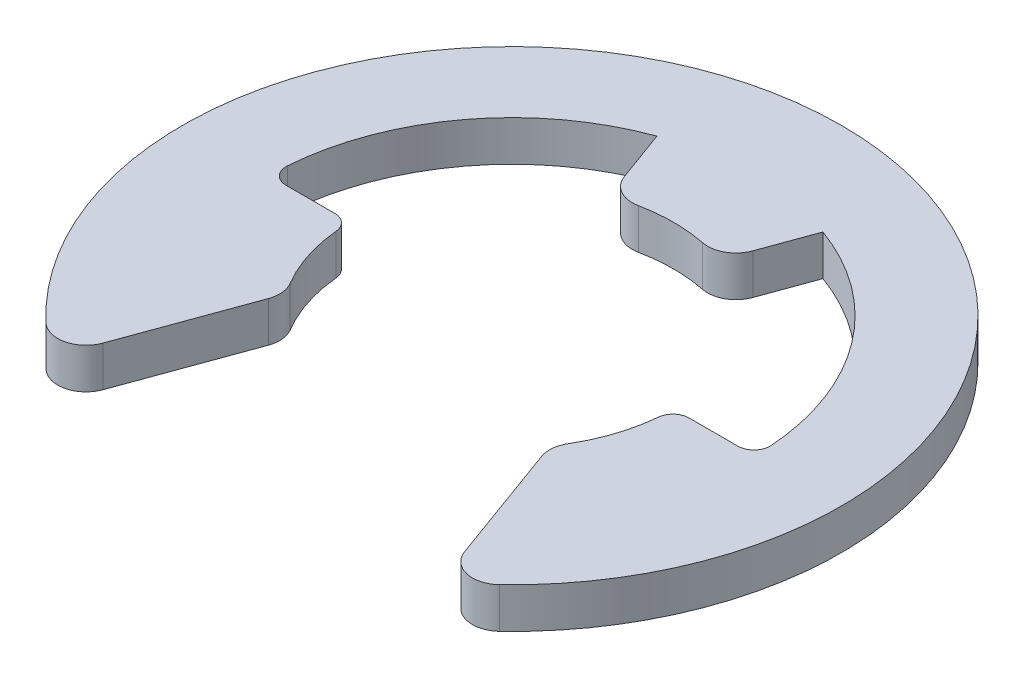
ISO-10303-21;
HEADER;
FILE_DESCRIPTION(('STEP AP214'),'2;1');
FILE_NAME('part.step','',(''),(''),'','','');
FILE_SCHEMA(('AUTOMOTIVE_DESIGN { 1 0 10303 214 1 1 1 1 }'));
ENDSEC;
DATA;
#1=APPLICATION_CONTEXT('core data for automotive mechanical design processes');
#2=APPLICATION_PROTOCOL_DEFINITION('international standard','automotive_design',2000,#1);
#3=PRODUCT_CONTEXT('',#1,'mechanical');
#4=PRODUCT('Part','Part','',(#3));
#5=PRODUCT_RELATED_PRODUCT_CATEGORY('part','',(#4));
#6=PRODUCT_DEFINITION_FORMATION('','',#4);
#7=PRODUCT_DEFINITION_CONTEXT('part definition',#1,'design');
#8=PRODUCT_DEFINITION('design','',#6,#7);
#9=PRODUCT_DEFINITION_SHAPE('','',#8);
#10=(LENGTH_UNIT() NAMED_UNIT(*) SI_UNIT(.MILLI.,.METRE.));
#11=(NAMED_UNIT(*) PLANE_ANGLE_UNIT() SI_UNIT($,.RADIAN.));
#12=(NAMED_UNIT(*) SI_UNIT($,.STERADIAN.) SOLID_ANGLE_UNIT());
#13=UNCERTAINTY_MEASURE_WITH_UNIT(LENGTH_MEASURE(1.E-05),#10,'distance_accuracy_value','');
#14=(GEOMETRIC_REPRESENTATION_CONTEXT(3) GLOBAL_UNCERTAINTY_ASSIGNED_CONTEXT((#13)) GLOBAL_UNIT_ASSIGNED_CONTEXT((#10,
#11,#12)) REPRESENTATION_CONTEXT('',''));
#15=CARTESIAN_POINT('',(0.,0.,0.));
#16=DIRECTION('',(0.,0.,1.));
#17=DIRECTION('',(1.,0.,0.));
#18=AXIS2_PLACEMENT_3D('',#15,#16,#17);
#19=CARTESIAN_POINT('',(0.,0.5,0.));
#20=DIRECTION('',(0.,-1.,0.));
#21=DIRECTION('',(0.,0.,-1.));
#22=AXIS2_PLACEMENT_3D('',#19,#20,#21);
#23=CYLINDRICAL_SURFACE('',#22,6.);
#24=CARTESIAN_POINT('',(0.,0.5,0.));
#25=DIRECTION('',(0.,-1.,0.));
#26=DIRECTION('',(0.,0.,1.));
#27=AXIS2_PLACEMENT_3D('',#24,#25,#26);
#28=CIRCLE('',#27,6.);
#29=CARTESIAN_POINT('',(-5.9846743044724,0.5,-0.428571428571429));
#30=VERTEX_POINT('',#29);
#31=CARTESIAN_POINT('',(-2.052120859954,0.5,-5.63815572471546));
#32=VERTEX_POINT('',#31);
#33=EDGE_CURVE('E187',#30,#32,#28,.T.);
#34=ORIENTED_EDGE('',*,*,#33,.F.);
#35=DIRECTION('',(0.,-1.,0.));
#36=VECTOR('',#35,1.);
#37=CARTESIAN_POINT('',(-5.9846743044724,0.5,-0.428571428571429));
#38=LINE('',#37,#36);
#39=CARTESIAN_POINT('',(-5.9846743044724,-0.5,-0.428571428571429));
#40=VERTEX_POINT('',#39);
#41=EDGE_CURVE('E328',#30,#40,#38,.T.);
#42=ORIENTED_EDGE('',*,*,#41,.T.);
#43=CARTESIAN_POINT('',(0.,-0.5,0.));
#44=DIRECTION('',(0.,-1.,0.));
#45=DIRECTION('',(0.,0.,1.));
#46=AXIS2_PLACEMENT_3D('',#43,#44,#45);
#47=CIRCLE('',#46,6.);
#48=CARTESIAN_POINT('',(-2.052120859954,-0.5,-5.63815572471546));
#49=VERTEX_POINT('',#48);
#50=EDGE_CURVE('E211',#40,#49,#47,.T.);
#51=ORIENTED_EDGE('',*,*,#50,.T.);
#52=DIRECTION('',(0.,-1.,0.));
#53=VECTOR('',#52,1.);
#54=CARTESIAN_POINT('',(-2.052120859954,0.5,-5.63815572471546));
#55=LINE('',#54,#53);
#56=EDGE_CURVE('E204',#32,#49,#55,.T.);
#57=ORIENTED_EDGE('',*,*,#56,.F.);
#58=EDGE_LOOP('',(#34,#42,#51,#57));
#59=FACE_BOUND('',#58,.T.);
#60=ADVANCED_FACE('F39',(#59),#23,.F.);
#61=CARTESIAN_POINT('',(-2.052120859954,0.5,-5.63815572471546));
#62=DIRECTION('',(0.939692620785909,0.,-0.342020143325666));
#63=DIRECTION('',(-0.342020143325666,0.,-0.939692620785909));
#64=AXIS2_PLACEMENT_3D('',#61,#62,#63);
#65=PLANE('',#64);
#66=DIRECTION('',(0.342020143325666,0.,0.939692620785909));
#67=VECTOR('',#66,1.);
#68=CARTESIAN_POINT('',(-2.052120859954,-0.5,-5.63815572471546));
#69=LINE('',#68,#67);
#70=CARTESIAN_POINT('',(-1.58956598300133,-0.5,-4.36729664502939));
#71=VERTEX_POINT('',#70);
#72=EDGE_CURVE('E449',#49,#71,#69,.T.);
#73=ORIENTED_EDGE('',*,*,#72,.T.);
#74=DIRECTION('',(0.,-1.,0.));
#75=VECTOR('',#74,1.);
#76=CARTESIAN_POINT('',(-1.58956598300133,0.5,-4.36729664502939));
#77=LINE('',#76,#75);
#78=CARTESIAN_POINT('',(-1.58956598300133,0.5,-4.36729664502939));
#79=VERTEX_POINT('',#78);
#80=EDGE_CURVE('E206',#71,#79,#77,.F.);
#81=ORIENTED_EDGE('',*,*,#80,.T.);
#82=DIRECTION('',(0.342020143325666,0.,0.939692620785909));
#83=VECTOR('',#82,1.);
#84=CARTESIAN_POINT('',(-2.052120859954,0.5,-5.63815572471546));
#85=LINE('',#84,#83);
#86=EDGE_CURVE('E191',#32,#79,#85,.T.);
#87=ORIENTED_EDGE('',*,*,#86,.F.);
#88=ORIENTED_EDGE('',*,*,#56,.T.);
#89=EDGE_LOOP('',(#73,#81,#87,#88));
#90=FACE_BOUND('',#89,.T.);
#91=ADVANCED_FACE('F203',(#90),#65,.F.);
#92=CARTESIAN_POINT('',(0.,0.5,0.));
#93=DIRECTION('',(0.,-1.,0.));
#94=DIRECTION('',(0.,0.,-1.));
#95=AXIS2_PLACEMENT_3D('',#92,#93,#94);
#96=CYLINDRICAL_SURFACE('',#95,4.);
#97=CARTESIAN_POINT('',(0.,-0.5,0.));
#98=DIRECTION('',(0.,-1.,0.));
#99=DIRECTION('',(0.,0.,1.));
#100=AXIS2_PLACEMENT_3D('',#97,#98,#99);
#101=CIRCLE('',#100,4.);
#102=CARTESIAN_POINT('',(-0.793005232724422,-0.5,-3.92060488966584));
#103=VERTEX_POINT('',#102);
#104=CARTESIAN_POINT('',(0.793005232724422,-0.5,-3.92060488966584));
#105=VERTEX_POINT('',#104);
#106=EDGE_CURVE('E452',#103,#105,#101,.T.);
#107=ORIENTED_EDGE('',*,*,#106,.T.);
#108=DIRECTION('',(0.,-1.,0.));
#109=VECTOR('',#108,1.);
#110=CARTESIAN_POINT('',(0.793005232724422,0.5,-3.92060488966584));
#111=LINE('',#110,#109);
#112=CARTESIAN_POINT('',(0.793005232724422,0.5,-3.92060488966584));
#113=VERTEX_POINT('',#112);
#114=EDGE_CURVE('E290',#105,#113,#111,.F.);
#115=ORIENTED_EDGE('',*,*,#114,.T.);
#116=CARTESIAN_POINT('',(0.,0.5,0.));
#117=DIRECTION('',(0.,-1.,0.));
#118=DIRECTION('',(0.,0.,1.));
#119=AXIS2_PLACEMENT_3D('',#116,#117,#118);
#120=CIRCLE('',#119,4.);
#121=CARTESIAN_POINT('',(-0.793005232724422,0.5,-3.92060488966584));
#122=VERTEX_POINT('',#121);
#123=EDGE_CURVE('E208',#122,#113,#120,.T.);
#124=ORIENTED_EDGE('',*,*,#123,.F.);
#125=DIRECTION('',(0.,-1.,0.));
#126=VECTOR('',#125,1.);
#127=CARTESIAN_POINT('',(-0.793005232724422,0.5,-3.92060488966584));
#128=LINE('',#127,#126);
#129=EDGE_CURVE('E287',#122,#103,#128,.T.);
#130=ORIENTED_EDGE('',*,*,#129,.T.);
#131=EDGE_LOOP('',(#107,#115,#124,#130));
#132=FACE_BOUND('',#131,.T.);
#133=ADVANCED_FACE('F371',(#132),#96,.F.);
#134=CARTESIAN_POINT('',(1.36808057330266,0.5,-3.75877048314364));
#135=DIRECTION('',(-0.93969262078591,0.,-0.342020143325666));
#136=DIRECTION('',(-0.342020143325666,0.,0.93969262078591));
#137=AXIS2_PLACEMENT_3D('',#134,#135,#136);
#138=PLANE('',#137);
#139=DIRECTION('',(0.342020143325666,0.,-0.93969262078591));
#140=VECTOR('',#139,1.);
#141=CARTESIAN_POINT('',(1.36808057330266,0.5,-3.75877048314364));
#142=LINE('',#141,#140);
#143=CARTESIAN_POINT('',(1.58956598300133,0.5,-4.36729664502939));
#144=VERTEX_POINT('',#143);
#145=CARTESIAN_POINT('',(2.05212085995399,0.5,-5.63815572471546));
#146=VERTEX_POINT('',#145);
#147=EDGE_CURVE('E426',#144,#146,#142,.T.);
#148=ORIENTED_EDGE('',*,*,#147,.F.);
#149=DIRECTION('',(0.,-1.,0.));
#150=VECTOR('',#149,1.);
#151=CARTESIAN_POINT('',(1.58956598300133,0.5,-4.36729664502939));
#152=LINE('',#151,#150);
#153=CARTESIAN_POINT('',(1.58956598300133,-0.5,-4.36729664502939));
#154=VERTEX_POINT('',#153);
#155=EDGE_CURVE('E283',#144,#154,#152,.T.);
#156=ORIENTED_EDGE('',*,*,#155,.T.);
#157=DIRECTION('',(0.342020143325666,0.,-0.93969262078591));
#158=VECTOR('',#157,1.);
#159=CARTESIAN_POINT('',(1.36808057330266,-0.5,-3.75877048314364));
#160=LINE('',#159,#158);
#161=CARTESIAN_POINT('',(2.05212085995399,-0.5,-5.63815572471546));
#162=VERTEX_POINT('',#161);
#163=EDGE_CURVE('E456',#154,#162,#160,.T.);
#164=ORIENTED_EDGE('',*,*,#163,.T.);
#165=DIRECTION('',(0.,-1.,0.));
#166=VECTOR('',#165,1.);
#167=CARTESIAN_POINT('',(2.05212085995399,0.5,-5.63815572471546));
#168=LINE('',#167,#166);
#169=EDGE_CURVE('E215',#146,#162,#168,.T.);
#170=ORIENTED_EDGE('',*,*,#169,.F.);
#171=EDGE_LOOP('',(#148,#156,#164,#170));
#172=FACE_BOUND('',#171,.T.);
#173=ADVANCED_FACE('F527',(#172),#138,.F.);
#174=CARTESIAN_POINT('',(0.,0.5,0.));
#175=DIRECTION('',(0.,-1.,0.));
#176=DIRECTION('',(0.,0.,-1.));
#177=AXIS2_PLACEMENT_3D('',#174,#175,#176);
#178=CYLINDRICAL_SURFACE('',#177,6.);
#179=CARTESIAN_POINT('',(0.,-0.5,0.));
#180=DIRECTION('',(0.,-1.,0.));
#181=DIRECTION('',(0.,0.,1.));
#182=AXIS2_PLACEMENT_3D('',#179,#180,#181);
#183=CIRCLE('',#182,6.);
#184=CARTESIAN_POINT('',(5.9846743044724,-0.5,-0.428571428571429));
#185=VERTEX_POINT('',#184);
#186=EDGE_CURVE('E459',#162,#185,#183,.T.);
#187=ORIENTED_EDGE('',*,*,#186,.T.);
#188=DIRECTION('',(0.,-1.,0.));
#189=VECTOR('',#188,1.);
#190=CARTESIAN_POINT('',(5.9846743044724,0.5,-0.428571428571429));
#191=LINE('',#190,#189);
#192=CARTESIAN_POINT('',(5.9846743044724,0.5,-0.428571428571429));
#193=VERTEX_POINT('',#192);
#194=EDGE_CURVE('E309',#185,#193,#191,.F.);
#195=ORIENTED_EDGE('',*,*,#194,.T.);
#196=CARTESIAN_POINT('',(0.,0.5,0.));
#197=DIRECTION('',(0.,-1.,0.));
#198=DIRECTION('',(0.,0.,1.));
#199=AXIS2_PLACEMENT_3D('',#196,#197,#198);
#200=CIRCLE('',#199,6.);
#201=EDGE_CURVE('E411',#146,#193,#200,.T.);
#202=ORIENTED_EDGE('',*,*,#201,.F.);
#203=ORIENTED_EDGE('',*,*,#169,.T.);
#204=EDGE_LOOP('',(#187,#195,#202,#203));
#205=FACE_BOUND('',#204,.T.);
#206=ADVANCED_FACE('F521',(#205),#178,.F.);
#207=CARTESIAN_POINT('',(4.,0.5,0.));
#208=DIRECTION('',(0.,0.,1.));
#209=DIRECTION('',(1.,0.,0.));
#210=AXIS2_PLACEMENT_3D('',#207,#208,#209);
#211=PLANE('',#210);
#212=DIRECTION('',(-1.,0.,0.));
#213=VECTOR('',#212,1.);
#214=CARTESIAN_POINT('',(4.,0.5,0.));
#215=LINE('',#214,#213);
#216=CARTESIAN_POINT('',(5.58569601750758,0.5,0.));
#217=VERTEX_POINT('',#216);
#218=CARTESIAN_POINT('',(4.38178046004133,0.5,0.));
#219=VERTEX_POINT('',#218);
#220=EDGE_CURVE('E408',#217,#219,#215,.T.);
#221=ORIENTED_EDGE('',*,*,#220,.F.);
#222=DIRECTION('',(0.,1.,0.));
#223=VECTOR('',#222,1.);
#224=CARTESIAN_POINT('',(5.58569601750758,-0.5,0.));
#225=LINE('',#224,#223);
#226=CARTESIAN_POINT('',(5.58569601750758,-0.5,0.));
#227=VERTEX_POINT('',#226);
#228=EDGE_CURVE('E305',#217,#227,#225,.F.);
#229=ORIENTED_EDGE('',*,*,#228,.T.);
#230=DIRECTION('',(-1.,0.,0.));
#231=VECTOR('',#230,1.);
#232=CARTESIAN_POINT('',(4.,-0.5,0.));
#233=LINE('',#232,#231);
#234=CARTESIAN_POINT('',(4.38178046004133,-0.5,0.));
#235=VERTEX_POINT('',#234);
#236=EDGE_CURVE('E462',#227,#235,#233,.T.);
#237=ORIENTED_EDGE('',*,*,#236,.T.);
#238=DIRECTION('',(0.,-1.,0.));
#239=VECTOR('',#238,1.);
#240=CARTESIAN_POINT('',(4.38178046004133,0.5,0.));
#241=LINE('',#240,#239);
#242=EDGE_CURVE('E302',#235,#219,#241,.F.);
#243=ORIENTED_EDGE('',*,*,#242,.T.);
#244=EDGE_LOOP('',(#221,#229,#237,#243));
#245=FACE_BOUND('',#244,.T.);
#246=ADVANCED_FACE('F413',(#245),#211,.F.);
#247=CARTESIAN_POINT('',(0.,0.5,0.));
#248=DIRECTION('',(0.,-1.,0.));
#249=DIRECTION('',(0.,0.,-1.));
#250=AXIS2_PLACEMENT_3D('',#247,#248,#249);
#251=CYLINDRICAL_SURFACE('',#250,4.);
#252=CARTESIAN_POINT('',(0.,0.5,0.));
#253=DIRECTION('',(0.,-1.,0.));
#254=DIRECTION('',(0.,0.,1.));
#255=AXIS2_PLACEMENT_3D('',#252,#253,#254);
#256=CIRCLE('',#255,4.);
#257=CARTESIAN_POINT('',(3.98343678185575,0.5,0.363636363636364));
#258=VERTEX_POINT('',#257);
#259=CARTESIAN_POINT('',(3.43590197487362,0.5,2.04806680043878));
#260=VERTEX_POINT('',#259);
#261=EDGE_CURVE('E418',#258,#260,#256,.T.);
#262=ORIENTED_EDGE('',*,*,#261,.F.);
#263=DIRECTION('',(0.,-1.,0.));
#264=VECTOR('',#263,1.);
#265=CARTESIAN_POINT('',(3.98343678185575,0.5,0.363636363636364));
#266=LINE('',#265,#264);
#267=CARTESIAN_POINT('',(3.98343678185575,-0.5,0.363636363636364));
#268=VERTEX_POINT('',#267);
#269=EDGE_CURVE('E312',#258,#268,#266,.T.);
#270=ORIENTED_EDGE('',*,*,#269,.T.);
#271=CARTESIAN_POINT('',(0.,-0.5,0.));
#272=DIRECTION('',(0.,-1.,0.));
#273=DIRECTION('',(0.,0.,1.));
#274=AXIS2_PLACEMENT_3D('',#271,#272,#273);
#275=CIRCLE('',#274,4.);
#276=CARTESIAN_POINT('',(3.43590197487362,-0.5,2.04806680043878));
#277=VERTEX_POINT('',#276);
#278=EDGE_CURVE('E465',#268,#277,#275,.T.);
#279=ORIENTED_EDGE('',*,*,#278,.T.);
#280=DIRECTION('',(0.,-1.,0.));
#281=VECTOR('',#280,1.);
#282=CARTESIAN_POINT('',(3.43590197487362,0.5,2.04806680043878));
#283=LINE('',#282,#281);
#284=EDGE_CURVE('E250',#277,#260,#283,.F.);
#285=ORIENTED_EDGE('',*,*,#284,.T.);
#286=EDGE_LOOP('',(#262,#270,#279,#285));
#287=FACE_BOUND('',#286,.T.);
#288=ADVANCED_FACE('F512',(#287),#251,.F.);
#289=CARTESIAN_POINT('',(3.25999999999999,0.5,2.31784382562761));
#290=DIRECTION('',(0.939692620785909,0.,-0.342020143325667));
#291=DIRECTION('',(-0.342020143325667,0.,-0.939692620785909));
#292=AXIS2_PLACEMENT_3D('',#289,#290,#291);
#293=PLANE('',#292);
#294=DIRECTION('',(0.342020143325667,0.,0.939692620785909));
#295=VECTOR('',#294,1.);
#296=CARTESIAN_POINT('',(3.25999999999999,0.5,2.31784382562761));
#297=LINE('',#296,#295);
#298=CARTESIAN_POINT('',(3.37939998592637,0.5,2.64589259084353));
#299=VERTEX_POINT('',#298);
#300=CARTESIAN_POINT('',(4.47043152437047,0.5,5.64347710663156));
#301=VERTEX_POINT('',#300);
#302=EDGE_CURVE('E423',#299,#301,#297,.T.);
#303=ORIENTED_EDGE('',*,*,#302,.F.);
#304=DIRECTION('',(0.,-1.,0.));
#305=VECTOR('',#304,1.);
#306=CARTESIAN_POINT('',(3.37939998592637,0.5,2.64589259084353));
#307=LINE('',#306,#305);
#308=CARTESIAN_POINT('',(3.37939998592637,-0.5,2.64589259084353));
#309=VERTEX_POINT('',#308);
#310=EDGE_CURVE('E220',#299,#309,#307,.T.);
#311=ORIENTED_EDGE('',*,*,#310,.T.);
#312=DIRECTION('',(0.342020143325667,0.,0.939692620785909));
#313=VECTOR('',#312,1.);
#314=CARTESIAN_POINT('',(3.25999999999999,-0.5,2.31784382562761));
#315=LINE('',#314,#313);
#316=CARTESIAN_POINT('',(4.47043152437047,-0.5,5.64347710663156));
#317=VERTEX_POINT('',#316);
#318=EDGE_CURVE('E467',#309,#317,#315,.T.);
#319=ORIENTED_EDGE('',*,*,#318,.T.);
#320=DIRECTION('',(0.,-1.,0.));
#321=VECTOR('',#320,1.);
#322=CARTESIAN_POINT('',(4.47043152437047,0.5,5.64347710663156));
#323=LINE('',#322,#321);
#324=EDGE_CURVE('E214',#317,#301,#323,.F.);
#325=ORIENTED_EDGE('',*,*,#324,.T.);
#326=EDGE_LOOP('',(#303,#311,#319,#325));
#327=FACE_BOUND('',#326,.T.);
#328=ADVANCED_FACE('F506',(#327),#293,.F.);
#329=CARTESIAN_POINT('',(0.,0.5,0.));
#330=DIRECTION('',(0.,-1.,0.));
#331=DIRECTION('',(0.,0.,-1.));
#332=AXIS2_PLACEMENT_3D('',#329,#330,#331);
#333=CYLINDRICAL_SURFACE('',#332,8.15);
#334=CARTESIAN_POINT('',(0.,0.5,0.));
#335=DIRECTION('',(0.,1.,0.));
#336=DIRECTION('',(0.,0.,1.));
#337=AXIS2_PLACEMENT_3D('',#334,#335,#336);
#338=CIRCLE('',#337,8.15);
#339=CARTESIAN_POINT('',(5.61006219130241,0.5,5.91182731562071));
#340=VERTEX_POINT('',#339);
#341=CARTESIAN_POINT('',(-5.61006219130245,0.5,5.91182731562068));
#342=VERTEX_POINT('',#341);
#343=EDGE_CURVE('E433',#340,#342,#338,.T.);
#344=ORIENTED_EDGE('',*,*,#343,.F.);
#345=DIRECTION('',(0.,-1.,0.));
#346=VECTOR('',#345,1.);
#347=CARTESIAN_POINT('',(5.61006219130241,0.5,5.91182731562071));
#348=LINE('',#347,#346);
#349=CARTESIAN_POINT('',(5.61006219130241,-0.5,5.91182731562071));
#350=VERTEX_POINT('',#349);
#351=EDGE_CURVE('E298',#340,#350,#348,.T.);
#352=ORIENTED_EDGE('',*,*,#351,.T.);
#353=CARTESIAN_POINT('',(0.,-0.5,0.));
#354=DIRECTION('',(0.,1.,0.));
#355=DIRECTION('',(0.,0.,1.));
#356=AXIS2_PLACEMENT_3D('',#353,#354,#355);
#357=CIRCLE('',#356,8.15);
#358=CARTESIAN_POINT('',(-5.61006219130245,-0.5,5.91182731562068));
#359=VERTEX_POINT('',#358);
#360=EDGE_CURVE('E470',#350,#359,#357,.T.);
#361=ORIENTED_EDGE('',*,*,#360,.T.);
#362=DIRECTION('',(0.,-1.,0.));
#363=VECTOR('',#362,1.);
#364=CARTESIAN_POINT('',(-5.61006219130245,0.5,5.91182731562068));
#365=LINE('',#364,#363);
#366=EDGE_CURVE('E295',#359,#342,#365,.F.);
#367=ORIENTED_EDGE('',*,*,#366,.T.);
#368=EDGE_LOOP('',(#344,#352,#361,#367));
#369=FACE_BOUND('',#368,.T.);
#370=ADVANCED_FACE('F499',(#369),#333,.T.);
#371=CARTESIAN_POINT('',(-4.81080670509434,0.5,6.57865022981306));
#372=DIRECTION('',(-0.939692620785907,0.,-0.342020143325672));
#373=DIRECTION('',(-0.342020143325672,0.,0.939692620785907));
#374=AXIS2_PLACEMENT_3D('',#371,#372,#373);
#375=PLANE('',#374);
#376=DIRECTION('',(0.342020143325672,0.,-0.939692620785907));
#377=VECTOR('',#376,1.);
#378=CARTESIAN_POINT('',(-4.81080670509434,-0.5,6.57865022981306));
#379=LINE('',#378,#377);
#380=CARTESIAN_POINT('',(-4.47043152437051,-0.5,5.64347710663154));
#381=VERTEX_POINT('',#380);
#382=CARTESIAN_POINT('',(-3.37939998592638,-0.5,2.64589259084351));
#383=VERTEX_POINT('',#382);
#384=EDGE_CURVE('E474',#381,#383,#379,.T.);
#385=ORIENTED_EDGE('',*,*,#384,.T.);
#386=DIRECTION('',(0.,-1.,0.));
#387=VECTOR('',#386,1.);
#388=CARTESIAN_POINT('',(-3.37939998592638,0.5,2.64589259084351));
#389=LINE('',#388,#387);
#390=CARTESIAN_POINT('',(-3.37939998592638,0.5,2.64589259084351));
#391=VERTEX_POINT('',#390);
#392=EDGE_CURVE('E280',#383,#391,#389,.F.);
#393=ORIENTED_EDGE('',*,*,#392,.T.);
#394=DIRECTION('',(0.342020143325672,0.,-0.939692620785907));
#395=VECTOR('',#394,1.);
#396=CARTESIAN_POINT('',(-4.81080670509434,0.5,6.57865022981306));
#397=LINE('',#396,#395);
#398=CARTESIAN_POINT('',(-4.47043152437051,0.5,5.64347710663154));
#399=VERTEX_POINT('',#398);
#400=EDGE_CURVE('E437',#399,#391,#397,.T.);
#401=ORIENTED_EDGE('',*,*,#400,.F.);
#402=DIRECTION('',(0.,-1.,0.));
#403=VECTOR('',#402,1.);
#404=CARTESIAN_POINT('',(-4.47043152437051,0.5,5.64347710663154));
#405=LINE('',#404,#403);
#406=EDGE_CURVE('E276',#399,#381,#405,.T.);
#407=ORIENTED_EDGE('',*,*,#406,.T.);
#408=EDGE_LOOP('',(#385,#393,#401,#407));
#409=FACE_BOUND('',#408,.T.);
#410=ADVANCED_FACE('F491',(#409),#375,.F.);
#411=CARTESIAN_POINT('',(0.,0.5,0.));
#412=DIRECTION('',(0.,-1.,0.));
#413=DIRECTION('',(0.,0.,-1.));
#414=AXIS2_PLACEMENT_3D('',#411,#412,#413);
#415=CYLINDRICAL_SURFACE('',#414,4.);
#416=CARTESIAN_POINT('',(0.,-0.5,0.));
#417=DIRECTION('',(0.,-1.,0.));
#418=DIRECTION('',(0.,0.,1.));
#419=AXIS2_PLACEMENT_3D('',#416,#417,#418);
#420=CIRCLE('',#419,4.);
#421=CARTESIAN_POINT('',(-3.43590197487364,-0.5,2.04806680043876));
#422=VERTEX_POINT('',#421);
#423=CARTESIAN_POINT('',(-3.98343678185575,-0.5,0.363636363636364));
#424=VERTEX_POINT('',#423);
#425=EDGE_CURVE('E354',#422,#424,#420,.T.);
#426=ORIENTED_EDGE('',*,*,#425,.T.);
#427=DIRECTION('',(0.,-1.,0.));
#428=VECTOR('',#427,1.);
#429=CARTESIAN_POINT('',(-3.98343678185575,0.5,0.363636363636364));
#430=LINE('',#429,#428);
#431=CARTESIAN_POINT('',(-3.98343678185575,0.5,0.363636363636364));
#432=VERTEX_POINT('',#431);
#433=EDGE_CURVE('E337',#424,#432,#430,.F.);
#434=ORIENTED_EDGE('',*,*,#433,.T.);
#435=CARTESIAN_POINT('',(0.,0.5,0.));
#436=DIRECTION('',(0.,-1.,0.));
#437=DIRECTION('',(0.,0.,1.));
#438=AXIS2_PLACEMENT_3D('',#435,#436,#437);
#439=CIRCLE('',#438,4.);
#440=CARTESIAN_POINT('',(-3.43590197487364,0.5,2.04806680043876));
#441=VERTEX_POINT('',#440);
#442=EDGE_CURVE('E441',#441,#432,#439,.T.);
#443=ORIENTED_EDGE('',*,*,#442,.F.);
#444=DIRECTION('',(0.,-1.,0.));
#445=VECTOR('',#444,1.);
#446=CARTESIAN_POINT('',(-3.43590197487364,0.5,2.04806680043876));
#447=LINE('',#446,#445);
#448=EDGE_CURVE('E272',#441,#422,#447,.T.);
#449=ORIENTED_EDGE('',*,*,#448,.T.);
#450=EDGE_LOOP('',(#426,#434,#443,#449));
#451=FACE_BOUND('',#450,.T.);
#452=ADVANCED_FACE('F483',(#451),#415,.F.);
#453=CARTESIAN_POINT('',(-4.,0.5,0.));
#454=DIRECTION('',(0.,0.,1.));
#455=DIRECTION('',(1.,0.,0.));
#456=AXIS2_PLACEMENT_3D('',#453,#454,#455);
#457=PLANE('',#456);
#458=DIRECTION('',(-1.,0.,0.));
#459=VECTOR('',#458,1.);
#460=CARTESIAN_POINT('',(-4.,-0.5,0.));
#461=LINE('',#460,#459);
#462=CARTESIAN_POINT('',(-4.38178046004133,-0.5,0.));
#463=VERTEX_POINT('',#462);
#464=CARTESIAN_POINT('',(-5.58569601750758,-0.5,0.));
#465=VERTEX_POINT('',#464);
#466=EDGE_CURVE('E198',#463,#465,#461,.T.);
#467=ORIENTED_EDGE('',*,*,#466,.T.);
#468=DIRECTION('',(0.,1.,0.));
#469=VECTOR('',#468,1.);
#470=CARTESIAN_POINT('',(-5.58569601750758,0.5,0.));
#471=LINE('',#470,#469);
#472=CARTESIAN_POINT('',(-5.58569601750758,0.5,0.));
#473=VERTEX_POINT('',#472);
#474=EDGE_CURVE('E61',#465,#473,#471,.T.);
#475=ORIENTED_EDGE('',*,*,#474,.T.);
#476=DIRECTION('',(-1.,0.,0.));
#477=VECTOR('',#476,1.);
#478=CARTESIAN_POINT('',(-4.,0.5,0.));
#479=LINE('',#478,#477);
#480=CARTESIAN_POINT('',(-4.38178046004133,0.5,0.));
#481=VERTEX_POINT('',#480);
#482=EDGE_CURVE('E224',#481,#473,#479,.T.);
#483=ORIENTED_EDGE('',*,*,#482,.F.);
#484=DIRECTION('',(0.,-1.,0.));
#485=VECTOR('',#484,1.);
#486=CARTESIAN_POINT('',(-4.38178046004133,0.5,0.));
#487=LINE('',#486,#485);
#488=EDGE_CURVE('E331',#481,#463,#487,.T.);
#489=ORIENTED_EDGE('',*,*,#488,.T.);
#490=EDGE_LOOP('',(#467,#475,#483,#489));
#491=FACE_BOUND('',#490,.T.);
#492=ADVANCED_FACE('F351',(#491),#457,.F.);
#493=CARTESIAN_POINT('',(0.,0.5,0.));
#494=DIRECTION('',(0.,1.,0.));
#495=DIRECTION('',(0.,0.,1.));
#496=AXIS2_PLACEMENT_3D('',#493,#494,#495);
#497=PLANE('',#496);
#498=ORIENTED_EDGE('',*,*,#220,.T.);
#499=CARTESIAN_POINT('',(4.38178046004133,0.5,0.4));
#500=DIRECTION('',(0.,1.,0.));
#501=DIRECTION('',(0.,0.,1.));
#502=AXIS2_PLACEMENT_3D('',#499,#500,#501);
#503=CIRCLE('',#502,0.4);
#504=EDGE_CURVE('E325',#219,#258,#503,.T.);
#505=ORIENTED_EDGE('',*,*,#504,.T.);
#506=ORIENTED_EDGE('',*,*,#261,.T.);
#507=CARTESIAN_POINT('',(4.03718482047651,0.5,2.40647849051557));
#508=DIRECTION('',(0.,1.,0.));
#509=DIRECTION('',(0.,0.,1.));
#510=AXIS2_PLACEMENT_3D('',#507,#508,#509);
#511=CIRCLE('',#510,0.7);
#512=EDGE_CURVE('E269',#260,#299,#511,.T.);
#513=ORIENTED_EDGE('',*,*,#512,.T.);
#514=ORIENTED_EDGE('',*,*,#302,.T.);
#515=CARTESIAN_POINT('',(5.12821635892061,0.5,5.4040630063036));
#516=DIRECTION('',(0.,1.,0.));
#517=DIRECTION('',(0.,0.,1.));
#518=AXIS2_PLACEMENT_3D('',#515,#516,#517);
#519=CIRCLE('',#518,0.7);
#520=EDGE_CURVE('E257',#301,#340,#519,.T.);
#521=ORIENTED_EDGE('',*,*,#520,.T.);
#522=ORIENTED_EDGE('',*,*,#343,.T.);
#523=CARTESIAN_POINT('',(-5.12821635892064,0.5,5.40406300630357));
#524=DIRECTION('',(0.,1.,0.));
#525=DIRECTION('',(0.,0.,1.));
#526=AXIS2_PLACEMENT_3D('',#523,#524,#525);
#527=CIRCLE('',#526,0.7);
#528=EDGE_CURVE('E254',#342,#399,#527,.T.);
#529=ORIENTED_EDGE('',*,*,#528,.T.);
#530=ORIENTED_EDGE('',*,*,#400,.T.);
#531=CARTESIAN_POINT('',(-4.03718482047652,0.5,2.40647849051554));
#532=DIRECTION('',(0.,1.,0.));
#533=DIRECTION('',(0.,0.,1.));
#534=AXIS2_PLACEMENT_3D('',#531,#532,#533);
#535=CIRCLE('',#534,0.7);
#536=EDGE_CURVE('E266',#391,#441,#535,.T.);
#537=ORIENTED_EDGE('',*,*,#536,.T.);
#538=ORIENTED_EDGE('',*,*,#442,.T.);
#539=CARTESIAN_POINT('',(-4.38178046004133,0.5,0.4));
#540=DIRECTION('',(0.,1.,0.));
#541=DIRECTION('',(0.,0.,1.));
#542=AXIS2_PLACEMENT_3D('',#539,#540,#541);
#543=CIRCLE('',#542,0.4);
#544=EDGE_CURVE('E322',#432,#481,#543,.T.);
#545=ORIENTED_EDGE('',*,*,#544,.T.);
#546=ORIENTED_EDGE('',*,*,#482,.T.);
#547=CARTESIAN_POINT('',(-5.58569601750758,0.5,-0.4));
#548=DIRECTION('',(0.,1.,0.));
#549=DIRECTION('',(0.,0.,1.));
#550=AXIS2_PLACEMENT_3D('',#547,#548,#549);
#551=CIRCLE('',#550,0.4);
#552=EDGE_CURVE('E11',#473,#30,#551,.F.);
#553=ORIENTED_EDGE('',*,*,#552,.T.);
#554=ORIENTED_EDGE('',*,*,#33,.T.);
#555=ORIENTED_EDGE('',*,*,#86,.T.);
#556=CARTESIAN_POINT('',(-0.931781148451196,0.5,-4.60671074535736));
#557=DIRECTION('',(0.,1.,0.));
#558=DIRECTION('',(0.,0.,1.));
#559=AXIS2_PLACEMENT_3D('',#556,#557,#558);
#560=CIRCLE('',#559,0.7);
#561=EDGE_CURVE('E260',#79,#122,#560,.T.);
#562=ORIENTED_EDGE('',*,*,#561,.T.);
#563=ORIENTED_EDGE('',*,*,#123,.T.);
#564=CARTESIAN_POINT('',(0.931781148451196,0.5,-4.60671074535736));
#565=DIRECTION('',(0.,1.,0.));
#566=DIRECTION('',(0.,0.,1.));
#567=AXIS2_PLACEMENT_3D('',#564,#565,#566);
#568=CIRCLE('',#567,0.7);
#569=EDGE_CURVE('E263',#113,#144,#568,.T.);
#570=ORIENTED_EDGE('',*,*,#569,.T.);
#571=ORIENTED_EDGE('',*,*,#147,.T.);
#572=ORIENTED_EDGE('',*,*,#201,.T.);
#573=CARTESIAN_POINT('',(5.58569601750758,0.5,-0.4));
#574=DIRECTION('',(0.,1.,0.));
#575=DIRECTION('',(0.,0.,1.));
#576=AXIS2_PLACEMENT_3D('',#573,#574,#575);
#577=CIRCLE('',#576,0.4);
#578=EDGE_CURVE('E343',#193,#217,#577,.F.);
#579=ORIENTED_EDGE('',*,*,#578,.T.);
#580=EDGE_LOOP('',(#498,#505,#506,#513,#514,#521,#522,#529,#530,#537,#538,#545,#546,#553,#554,
#555,#562,#563,#570,#571,#572,#579));
#581=FACE_BOUND('',#580,.T.);
#582=ADVANCED_FACE('F190',(#581),#497,.T.);
#583=CARTESIAN_POINT('',(0.,-0.5,0.));
#584=DIRECTION('',(0.,1.,0.));
#585=DIRECTION('',(0.,0.,1.));
#586=AXIS2_PLACEMENT_3D('',#583,#584,#585);
#587=PLANE('',#586);
#588=ORIENTED_EDGE('',*,*,#278,.F.);
#589=CARTESIAN_POINT('',(4.38178046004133,-0.5,0.4));
#590=DIRECTION('',(0.,1.,0.));
#591=DIRECTION('',(0.,0.,1.));
#592=AXIS2_PLACEMENT_3D('',#589,#590,#591);
#593=CIRCLE('',#592,0.4);
#594=EDGE_CURVE('E319',#268,#235,#593,.F.);
#595=ORIENTED_EDGE('',*,*,#594,.T.);
#596=ORIENTED_EDGE('',*,*,#236,.F.);
#597=CARTESIAN_POINT('',(5.58569601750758,-0.5,-0.4));
#598=DIRECTION('',(0.,1.,0.));
#599=DIRECTION('',(0.,0.,1.));
#600=AXIS2_PLACEMENT_3D('',#597,#598,#599);
#601=CIRCLE('',#600,0.4);
#602=EDGE_CURVE('E340',#227,#185,#601,.T.);
#603=ORIENTED_EDGE('',*,*,#602,.T.);
#604=ORIENTED_EDGE('',*,*,#186,.F.);
#605=ORIENTED_EDGE('',*,*,#163,.F.);
#606=CARTESIAN_POINT('',(0.931781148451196,-0.5,-4.60671074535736));
#607=DIRECTION('',(0.,1.,0.));
#608=DIRECTION('',(0.,0.,1.));
#609=AXIS2_PLACEMENT_3D('',#606,#607,#608);
#610=CIRCLE('',#609,0.7);
#611=EDGE_CURVE('E240',#154,#105,#610,.F.);
#612=ORIENTED_EDGE('',*,*,#611,.T.);
#613=ORIENTED_EDGE('',*,*,#106,.F.);
#614=CARTESIAN_POINT('',(-0.931781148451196,-0.5,-4.60671074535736));
#615=DIRECTION('',(0.,1.,0.));
#616=DIRECTION('',(0.,0.,1.));
#617=AXIS2_PLACEMENT_3D('',#614,#615,#616);
#618=CIRCLE('',#617,0.7);
#619=EDGE_CURVE('E237',#103,#71,#618,.F.);
#620=ORIENTED_EDGE('',*,*,#619,.T.);
#621=ORIENTED_EDGE('',*,*,#72,.F.);
#622=ORIENTED_EDGE('',*,*,#50,.F.);
#623=CARTESIAN_POINT('',(-5.58569601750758,-0.5,-0.4));
#624=DIRECTION('',(0.,1.,0.));
#625=DIRECTION('',(0.,0.,1.));
#626=AXIS2_PLACEMENT_3D('',#623,#624,#625);
#627=CIRCLE('',#626,0.4);
#628=EDGE_CURVE('E48',#40,#465,#627,.T.);
#629=ORIENTED_EDGE('',*,*,#628,.T.);
#630=ORIENTED_EDGE('',*,*,#466,.F.);
#631=CARTESIAN_POINT('',(-4.38178046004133,-0.5,0.4));
#632=DIRECTION('',(0.,1.,0.));
#633=DIRECTION('',(0.,0.,1.));
#634=AXIS2_PLACEMENT_3D('',#631,#632,#633);
#635=CIRCLE('',#634,0.4);
#636=EDGE_CURVE('E316',#463,#424,#635,.F.);
#637=ORIENTED_EDGE('',*,*,#636,.T.);
#638=ORIENTED_EDGE('',*,*,#425,.F.);
#639=CARTESIAN_POINT('',(-4.03718482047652,-0.5,2.40647849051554));
#640=DIRECTION('',(0.,1.,0.));
#641=DIRECTION('',(0.,0.,1.));
#642=AXIS2_PLACEMENT_3D('',#639,#640,#641);
#643=CIRCLE('',#642,0.7);
#644=EDGE_CURVE('E243',#422,#383,#643,.F.);
#645=ORIENTED_EDGE('',*,*,#644,.T.);
#646=ORIENTED_EDGE('',*,*,#384,.F.);
#647=CARTESIAN_POINT('',(-5.12821635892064,-0.5,5.40406300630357));
#648=DIRECTION('',(0.,1.,0.));
#649=DIRECTION('',(0.,0.,1.));
#650=AXIS2_PLACEMENT_3D('',#647,#648,#649);
#651=CIRCLE('',#650,0.7);
#652=EDGE_CURVE('E231',#381,#359,#651,.F.);
#653=ORIENTED_EDGE('',*,*,#652,.T.);
#654=ORIENTED_EDGE('',*,*,#360,.F.);
#655=CARTESIAN_POINT('',(5.12821635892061,-0.5,5.4040630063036));
#656=DIRECTION('',(0.,1.,0.));
#657=DIRECTION('',(0.,0.,1.));
#658=AXIS2_PLACEMENT_3D('',#655,#656,#657);
#659=CIRCLE('',#658,0.7);
#660=EDGE_CURVE('E234',#350,#317,#659,.F.);
#661=ORIENTED_EDGE('',*,*,#660,.T.);
#662=ORIENTED_EDGE('',*,*,#318,.F.);
#663=CARTESIAN_POINT('',(4.03718482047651,-0.5,2.40647849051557));
#664=DIRECTION('',(0.,1.,0.));
#665=DIRECTION('',(0.,0.,1.));
#666=AXIS2_PLACEMENT_3D('',#663,#664,#665);
#667=CIRCLE('',#666,0.7);
#668=EDGE_CURVE('E246',#309,#277,#667,.F.);
#669=ORIENTED_EDGE('',*,*,#668,.T.);
#670=EDGE_LOOP('',(#588,#595,#596,#603,#604,#605,#612,#613,#620,#621,#622,#629,#630,#637,#638,
#645,#646,#653,#654,#661,#662,#669));
#671=FACE_BOUND('',#670,.T.);
#672=ADVANCED_FACE('F349',(#671),#587,.F.);
#673=CARTESIAN_POINT('',(4.03718482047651,0.5,2.40647849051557));
#674=DIRECTION('',(0.,-1.,0.));
#675=DIRECTION('',(0.,0.,-1.));
#676=AXIS2_PLACEMENT_3D('',#673,#674,#675);
#677=CYLINDRICAL_SURFACE('',#676,0.7);
#678=ORIENTED_EDGE('',*,*,#512,.F.);
#679=ORIENTED_EDGE('',*,*,#284,.F.);
#680=ORIENTED_EDGE('',*,*,#668,.F.);
#681=ORIENTED_EDGE('',*,*,#310,.F.);
#682=EDGE_LOOP('',(#678,#679,#680,#681));
#683=FACE_BOUND('',#682,.T.);
#684=ADVANCED_FACE('F375',(#683),#677,.T.);
#685=CARTESIAN_POINT('',(-4.03718482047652,0.5,2.40647849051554));
#686=DIRECTION('',(0.,-1.,0.));
#687=DIRECTION('',(0.,0.,-1.));
#688=AXIS2_PLACEMENT_3D('',#685,#686,#687);
#689=CYLINDRICAL_SURFACE('',#688,0.7);
#690=ORIENTED_EDGE('',*,*,#536,.F.);
#691=ORIENTED_EDGE('',*,*,#392,.F.);
#692=ORIENTED_EDGE('',*,*,#644,.F.);
#693=ORIENTED_EDGE('',*,*,#448,.F.);
#694=EDGE_LOOP('',(#690,#691,#692,#693));
#695=FACE_BOUND('',#694,.T.);
#696=ADVANCED_FACE('F378',(#695),#689,.T.);
#697=CARTESIAN_POINT('',(0.931781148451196,0.5,-4.60671074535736));
#698=DIRECTION('',(0.,-1.,0.));
#699=DIRECTION('',(0.,0.,-1.));
#700=AXIS2_PLACEMENT_3D('',#697,#698,#699);
#701=CYLINDRICAL_SURFACE('',#700,0.7);
#702=ORIENTED_EDGE('',*,*,#569,.F.);
#703=ORIENTED_EDGE('',*,*,#114,.F.);
#704=ORIENTED_EDGE('',*,*,#611,.F.);
#705=ORIENTED_EDGE('',*,*,#155,.F.);
#706=EDGE_LOOP('',(#702,#703,#704,#705));
#707=FACE_BOUND('',#706,.T.);
#708=ADVANCED_FACE('F382',(#707),#701,.T.);
#709=CARTESIAN_POINT('',(-0.931781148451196,0.5,-4.60671074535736));
#710=DIRECTION('',(0.,-1.,0.));
#711=DIRECTION('',(0.,0.,-1.));
#712=AXIS2_PLACEMENT_3D('',#709,#710,#711);
#713=CYLINDRICAL_SURFACE('',#712,0.7);
#714=ORIENTED_EDGE('',*,*,#561,.F.);
#715=ORIENTED_EDGE('',*,*,#80,.F.);
#716=ORIENTED_EDGE('',*,*,#619,.F.);
#717=ORIENTED_EDGE('',*,*,#129,.F.);
#718=EDGE_LOOP('',(#714,#715,#716,#717));
#719=FACE_BOUND('',#718,.T.);
#720=ADVANCED_FACE('F386',(#719),#713,.T.);
#721=CARTESIAN_POINT('',(5.12821635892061,0.5,5.4040630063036));
#722=DIRECTION('',(0.,-1.,0.));
#723=DIRECTION('',(0.,0.,-1.));
#724=AXIS2_PLACEMENT_3D('',#721,#722,#723);
#725=CYLINDRICAL_SURFACE('',#724,0.7);
#726=ORIENTED_EDGE('',*,*,#520,.F.);
#727=ORIENTED_EDGE('',*,*,#324,.F.);
#728=ORIENTED_EDGE('',*,*,#660,.F.);
#729=ORIENTED_EDGE('',*,*,#351,.F.);
#730=EDGE_LOOP('',(#726,#727,#728,#729));
#731=FACE_BOUND('',#730,.T.);
#732=ADVANCED_FACE('F390',(#731),#725,.T.);
#733=CARTESIAN_POINT('',(-5.12821635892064,0.5,5.40406300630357));
#734=DIRECTION('',(0.,-1.,0.));
#735=DIRECTION('',(0.,0.,-1.));
#736=AXIS2_PLACEMENT_3D('',#733,#734,#735);
#737=CYLINDRICAL_SURFACE('',#736,0.7);
#738=ORIENTED_EDGE('',*,*,#528,.F.);
#739=ORIENTED_EDGE('',*,*,#366,.F.);
#740=ORIENTED_EDGE('',*,*,#652,.F.);
#741=ORIENTED_EDGE('',*,*,#406,.F.);
#742=EDGE_LOOP('',(#738,#739,#740,#741));
#743=FACE_BOUND('',#742,.T.);
#744=ADVANCED_FACE('F394',(#743),#737,.T.);
#745=CARTESIAN_POINT('',(5.58569601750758,0.5,-0.4));
#746=DIRECTION('',(0.,-1.,0.));
#747=DIRECTION('',(0.,0.,-1.));
#748=AXIS2_PLACEMENT_3D('',#745,#746,#747);
#749=CYLINDRICAL_SURFACE('',#748,0.4);
#750=ORIENTED_EDGE('',*,*,#578,.F.);
#751=ORIENTED_EDGE('',*,*,#194,.F.);
#752=ORIENTED_EDGE('',*,*,#602,.F.);
#753=ORIENTED_EDGE('',*,*,#228,.F.);
#754=EDGE_LOOP('',(#750,#751,#752,#753));
#755=FACE_BOUND('',#754,.T.);
#756=ADVANCED_FACE('F363',(#755),#749,.F.);
#757=CARTESIAN_POINT('',(4.38178046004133,0.5,0.4));
#758=DIRECTION('',(0.,-1.,0.));
#759=DIRECTION('',(0.,0.,-1.));
#760=AXIS2_PLACEMENT_3D('',#757,#758,#759);
#761=CYLINDRICAL_SURFACE('',#760,0.4);
#762=ORIENTED_EDGE('',*,*,#504,.F.);
#763=ORIENTED_EDGE('',*,*,#242,.F.);
#764=ORIENTED_EDGE('',*,*,#594,.F.);
#765=ORIENTED_EDGE('',*,*,#269,.F.);
#766=EDGE_LOOP('',(#762,#763,#764,#765));
#767=FACE_BOUND('',#766,.T.);
#768=ADVANCED_FACE('F357',(#767),#761,.T.);
#769=CARTESIAN_POINT('',(-5.58569601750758,0.5,-0.4));
#770=DIRECTION('',(0.,-1.,0.));
#771=DIRECTION('',(0.,0.,-1.));
#772=AXIS2_PLACEMENT_3D('',#769,#770,#771);
#773=CYLINDRICAL_SURFACE('',#772,0.4);
#774=ORIENTED_EDGE('',*,*,#552,.F.);
#775=ORIENTED_EDGE('',*,*,#474,.F.);
#776=ORIENTED_EDGE('',*,*,#628,.F.);
#777=ORIENTED_EDGE('',*,*,#41,.F.);
#778=EDGE_LOOP('',(#774,#775,#776,#777));
#779=FACE_BOUND('',#778,.T.);
#780=ADVANCED_FACE('F355',(#779),#773,.F.);
#781=CARTESIAN_POINT('',(-4.38178046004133,0.5,0.4));
#782=DIRECTION('',(0.,-1.,0.));
#783=DIRECTION('',(0.,0.,-1.));
#784=AXIS2_PLACEMENT_3D('',#781,#782,#783);
#785=CYLINDRICAL_SURFACE('',#784,0.4);
#786=ORIENTED_EDGE('',*,*,#544,.F.);
#787=ORIENTED_EDGE('',*,*,#433,.F.);
#788=ORIENTED_EDGE('',*,*,#636,.F.);
#789=ORIENTED_EDGE('',*,*,#488,.F.);
#790=EDGE_LOOP('',(#786,#787,#788,#789));
#791=FACE_BOUND('',#790,.T.);
#792=ADVANCED_FACE('F41',(#791),#785,.T.);
#793=CLOSED_SHELL('',(#60,#91,#133,#173,#206,#246,#288,#328,#370,#410,#452,#492,#582,#672,#684,
#696,#708,#720,#732,#744,#756,#768,#780,#792));
#794=MANIFOLD_SOLID_BREP('B2',#793);
#795=ADVANCED_BREP_SHAPE_REPRESENTATION('',(#18,#794),#14);
#796=SHAPE_DEFINITION_REPRESENTATION(#9,#795);
ENDSEC;
END-ISO-10303-21;
